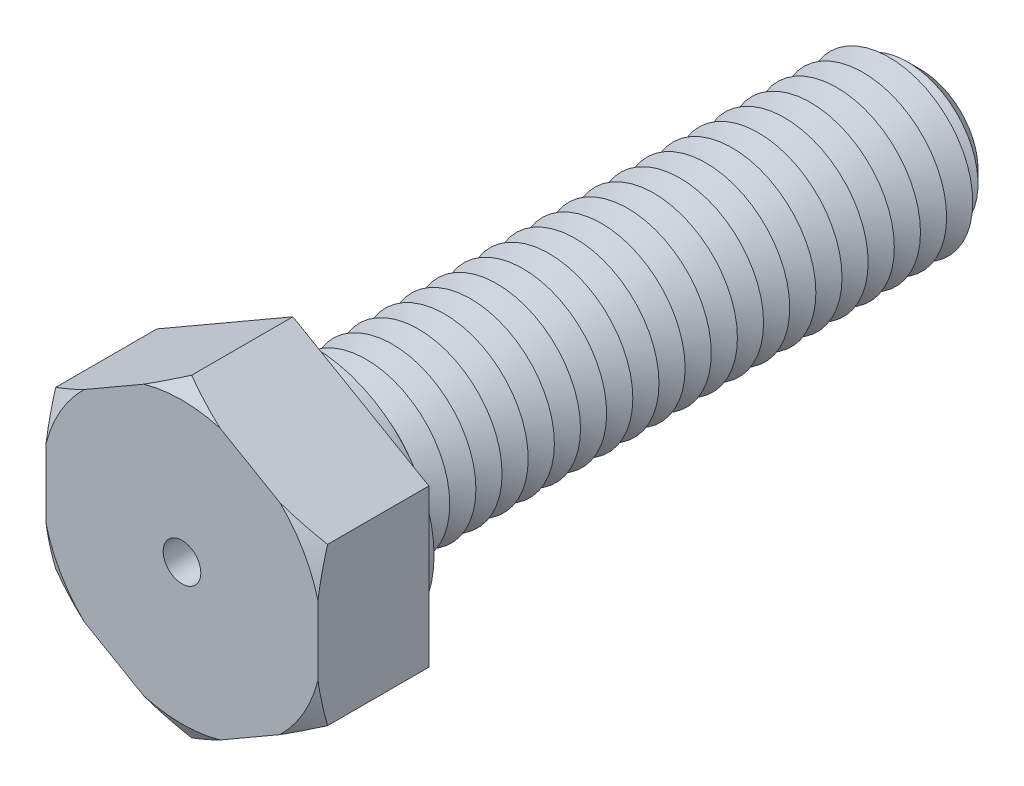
from build123d import *

# Parameters (mm, degrees)
BOSS_EXTRUDE1_DEPTH = 5.3
SKETCH3_R           = 4
BOSS_EXTRUDE2_DEPTH = 30
SKETCH4_R           = 5.75
BOSS_EXTRUDE3_DEPTH = 1
CHAMFER1_SIZE       = 1.25
LPATTERN1_COUNT     = 23
LPATTERN1_PITCH     = 1.25
SKETCH8_R           = 0.9
CUT_EXTRUDE1_DEPTH  = 35.3


with BuildPart() as part:
    # Sketch2 → Boss-Extrude1 (new body)
    with BuildSketch(Plane.XY):
        Polygon((0, 7.505553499), (-6.5, 3.75277675), (-6.5, -3.75277675), (0, -7.505553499), (6.5, -3.75277675), (6.5, 3.75277675), align=None)
    extrude(amount=BOSS_EXTRUDE1_DEPTH)

    # Sketch3 → Boss-Extrude2 (add)
    with BuildSketch(Plane(origin=(0, 0, 0), x_dir=(-1, 0, 0), z_dir=(0, 0, -1))):
        Circle(SKETCH3_R)
    extrude(amount=BOSS_EXTRUDE2_DEPTH)

    # Sketch4 → Boss-Extrude3 (add)
    with BuildSketch(Plane(origin=(0, 0, 0), x_dir=(-1, 0, 0), z_dir=(0, 0, -1))):
        with Locations(Location((0, 0, 0), (0, 0, 180))):
            Circle(SKETCH4_R)
    extrude(amount=BOSS_EXTRUDE3_DEPTH)

    # Chamfer1
    chamfer1_edges = [part.edges().sort_by_distance(p)[0] for p in [
        (4, 0, -30),
    ]]
    chamfer(chamfer1_edges, length=CHAMFER1_SIZE)

    # Sketch6 → Cut-Revolve1 (revolve, cut)
    with BuildSketch(Plane(origin=(0, 0, 0), x_dir=(0, 0, -1), z_dir=(1, 0, 0)), mode=Mode.PRIVATE) as cut_revolve1_sk:
        Polygon((1, 4), (1.625, 2.917468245), (2.25, 4), align=None)
    cut_revolve1 = revolve(cut_revolve1_sk.sketch.rotate(Axis((0, 0, 3.211670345), (0, 0, -1)), 90), axis=Axis((0, 0, 3.211670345), (0, 0, -1)), mode=Mode.SUBTRACT)

    # LPattern1: Cut-Revolve1 ×23
    with Locations(*[(0, 0, -i * LPATTERN1_PITCH) for i in range(1, LPATTERN1_COUNT)]):
        add(cut_revolve1, mode=Mode.SUBTRACT)

    # Sketch7 → Cut-Revolve2 (revolve, cut)
    with BuildSketch(Plane(origin=(0, 0, 0), x_dir=(0, 0, -1), z_dir=(1, 0, 0)), mode=Mode.PRIVATE) as cut_revolve2_sk:
        Polygon((-5.3, 7.505553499), (-5.3, 6.705553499), (-4.838119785, 7.505553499), align=None)
    revolve(cut_revolve2_sk.sketch.rotate(Axis((0, 0, 3.211670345), (0, 0, -1)), 270), axis=Axis((0, 0, 3.211670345), (0, 0, -1)), mode=Mode.SUBTRACT)

    # Sketch8 → Cut-Extrude1 (cut)
    with BuildSketch(Plane.XY.offset(5.3)):
        Circle(SKETCH8_R)
    extrude(amount=-CUT_EXTRUDE1_DEPTH, mode=Mode.SUBTRACT)


solid = part.part
